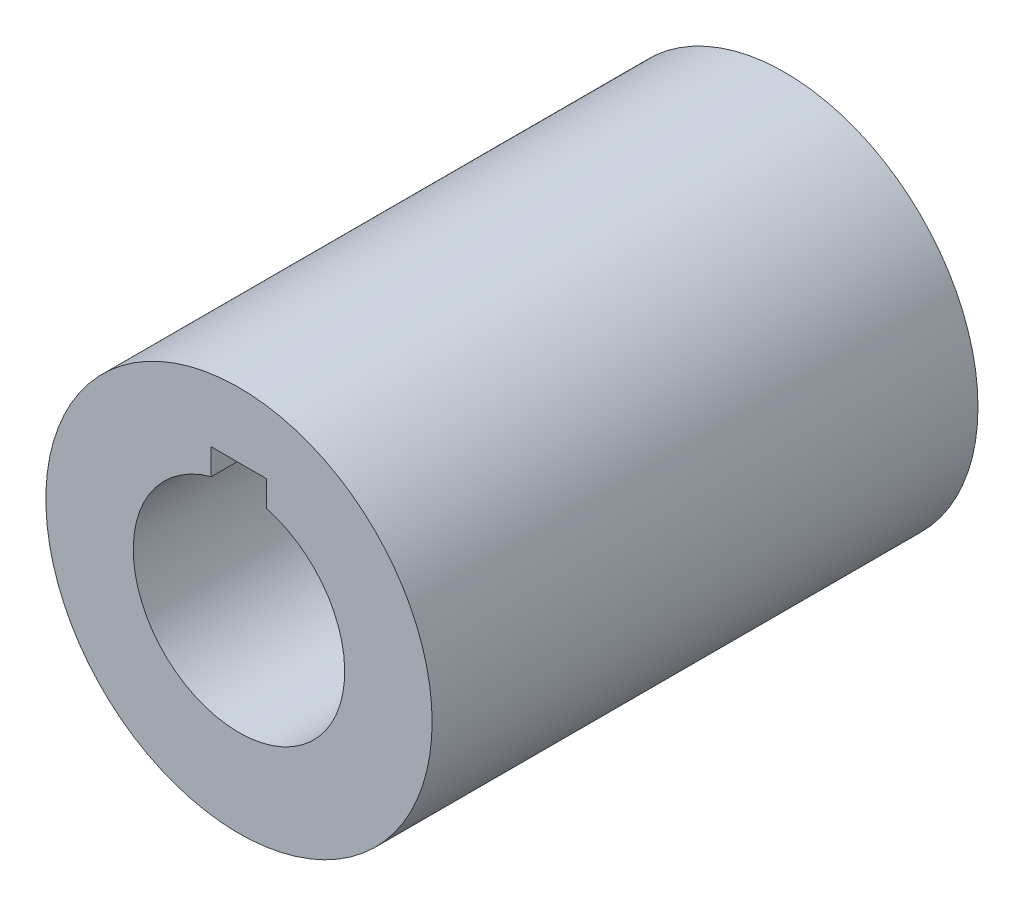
from build123d import *

# Parameters (mm, degrees)
CROQUIS1_R     = 17.4
EXTRUIR1_DEPTH = 49.18


with BuildPart() as part:
    # Croquis1 → Extruir1 (new body)
    with BuildSketch(Plane.XY):
        Circle(CROQUIS1_R)
        with BuildLine():
            Line((-2.5, 11.525), (2.5, 11.525))
            Line((2.5, 11.525), (2.5, 9.191062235))
            ThreePointArc((2.5, 9.191062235), (0, -9.525), (-2.5, 9.191062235))
            Line((-2.5, 9.191062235), (-2.5, 11.525))
        make_face(mode=Mode.SUBTRACT)
    extrude(amount=EXTRUIR1_DEPTH)


solid = part.part
